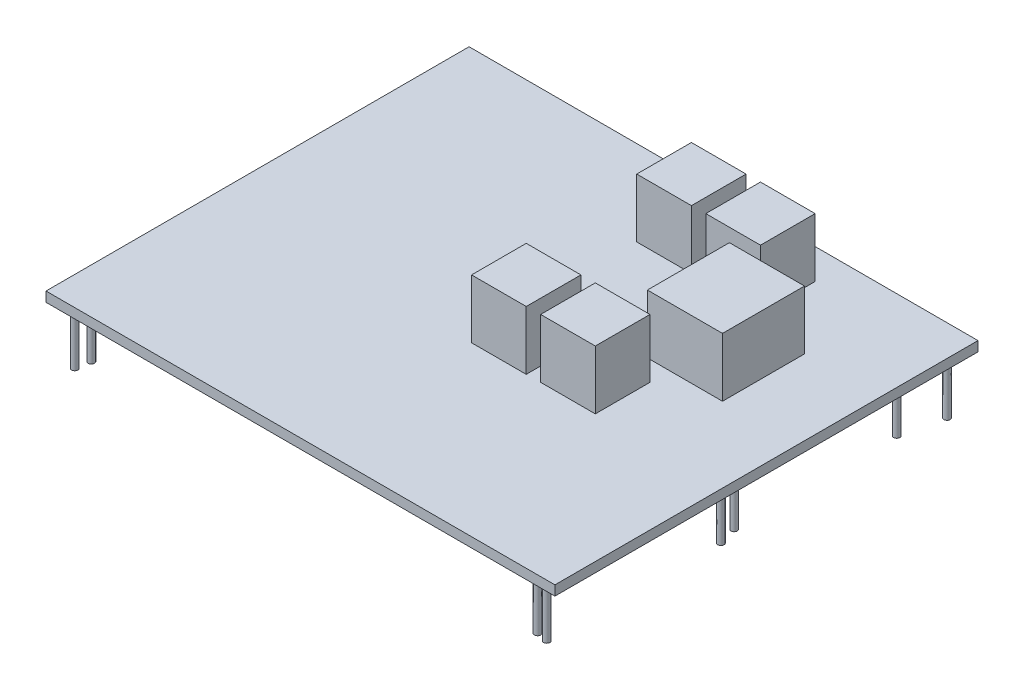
ISO-10303-21;
HEADER;
FILE_DESCRIPTION(('STEP AP214'),'2;1');
FILE_NAME('part.step','',(''),(''),'','','');
FILE_SCHEMA(('AUTOMOTIVE_DESIGN { 1 0 10303 214 1 1 1 1 }'));
ENDSEC;
DATA;
#1=APPLICATION_CONTEXT('core data for automotive mechanical design processes');
#2=APPLICATION_PROTOCOL_DEFINITION('international standard','automotive_design',2000,#1);
#3=PRODUCT_CONTEXT('',#1,'mechanical');
#4=PRODUCT('Part','Part','',(#3));
#5=PRODUCT_RELATED_PRODUCT_CATEGORY('part','',(#4));
#6=PRODUCT_DEFINITION_FORMATION('','',#4);
#7=PRODUCT_DEFINITION_CONTEXT('part definition',#1,'design');
#8=PRODUCT_DEFINITION('design','',#6,#7);
#9=PRODUCT_DEFINITION_SHAPE('','',#8);
#10=(LENGTH_UNIT() NAMED_UNIT(*) SI_UNIT(.MILLI.,.METRE.));
#11=(NAMED_UNIT(*) PLANE_ANGLE_UNIT() SI_UNIT($,.RADIAN.));
#12=(NAMED_UNIT(*) SI_UNIT($,.STERADIAN.) SOLID_ANGLE_UNIT());
#13=UNCERTAINTY_MEASURE_WITH_UNIT(LENGTH_MEASURE(1.E-05),#10,'distance_accuracy_value','');
#14=(GEOMETRIC_REPRESENTATION_CONTEXT(3) GLOBAL_UNCERTAINTY_ASSIGNED_CONTEXT((#13)) GLOBAL_UNIT_ASSIGNED_CONTEXT((#10,
#11,#12)) REPRESENTATION_CONTEXT('',''));
#15=CARTESIAN_POINT('',(0.,0.,0.));
#16=DIRECTION('',(0.,0.,1.));
#17=DIRECTION('',(1.,0.,0.));
#18=AXIS2_PLACEMENT_3D('',#15,#16,#17);
#19=CARTESIAN_POINT('',(0.,5.,0.));
#20=DIRECTION('',(0.,1.,0.));
#21=DIRECTION('',(0.,0.,1.));
#22=AXIS2_PLACEMENT_3D('',#19,#20,#21);
#23=PLANE('',#22);
#24=DIRECTION('',(0.,0.,1.));
#25=VECTOR('',#24,1.);
#26=CARTESIAN_POINT('',(-326.57219381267,5.,-108.190534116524));
#27=LINE('',#26,#25);
#28=CARTESIAN_POINT('',(-326.57219381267,5.,-108.190534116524));
#29=VERTEX_POINT('',#28);
#30=CARTESIAN_POINT('',(-326.57219381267,5.,107.709465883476));
#31=VERTEX_POINT('',#30);
#32=EDGE_CURVE('E536',#29,#31,#27,.T.);
#33=ORIENTED_EDGE('',*,*,#32,.T.);
#34=DIRECTION('',(1.,0.,0.));
#35=VECTOR('',#34,1.);
#36=CARTESIAN_POINT('',(-326.57219381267,5.,107.709465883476));
#37=LINE('',#36,#35);
#38=CARTESIAN_POINT('',(-66.8621938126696,5.,107.709465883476));
#39=VERTEX_POINT('',#38);
#40=EDGE_CURVE('E540',#31,#39,#37,.T.);
#41=ORIENTED_EDGE('',*,*,#40,.T.);
#42=DIRECTION('',(0.,0.,-1.));
#43=VECTOR('',#42,1.);
#44=CARTESIAN_POINT('',(-66.8621938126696,5.,-108.190534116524));
#45=LINE('',#44,#43);
#46=CARTESIAN_POINT('',(-66.8621938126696,5.,-108.190534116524));
#47=VERTEX_POINT('',#46);
#48=EDGE_CURVE('E544',#39,#47,#45,.T.);
#49=ORIENTED_EDGE('',*,*,#48,.T.);
#50=DIRECTION('',(-1.,0.,0.));
#51=VECTOR('',#50,1.);
#52=CARTESIAN_POINT('',(-326.57219381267,5.,-108.190534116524));
#53=LINE('',#52,#51);
#54=EDGE_CURVE('E547',#47,#29,#53,.T.);
#55=ORIENTED_EDGE('',*,*,#54,.T.);
#56=EDGE_LOOP('',(#33,#41,#49,#55));
#57=FACE_BOUND('',#56,.T.);
#58=DIRECTION('',(1.,0.,0.));
#59=VECTOR('',#58,1.);
#60=CARTESIAN_POINT('',(-143.558763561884,5.,-16.1733785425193));
#61=LINE('',#60,#59);
#62=CARTESIAN_POINT('',(-143.558763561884,5.,-16.1733785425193));
#63=VERTEX_POINT('',#62);
#64=CARTESIAN_POINT('',(-105.231829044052,5.,-16.1733785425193));
#65=VERTEX_POINT('',#64);
#66=EDGE_CURVE('E385',#63,#65,#61,.T.);
#67=ORIENTED_EDGE('',*,*,#66,.F.);
#68=DIRECTION('',(0.,0.,1.));
#69=VECTOR('',#68,1.);
#70=CARTESIAN_POINT('',(-143.558763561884,5.,-58.0246288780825));
#71=LINE('',#70,#69);
#72=CARTESIAN_POINT('',(-143.558763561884,5.,-58.0246288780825));
#73=VERTEX_POINT('',#72);
#74=EDGE_CURVE('E355',#73,#63,#71,.T.);
#75=ORIENTED_EDGE('',*,*,#74,.F.);
#76=DIRECTION('',(-1.,0.,0.));
#77=VECTOR('',#76,1.);
#78=CARTESIAN_POINT('',(-143.558763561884,5.,-58.0246288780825));
#79=LINE('',#78,#77);
#80=CARTESIAN_POINT('',(-105.231829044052,5.,-58.0246288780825));
#81=VERTEX_POINT('',#80);
#82=EDGE_CURVE('E372',#81,#73,#79,.T.);
#83=ORIENTED_EDGE('',*,*,#82,.F.);
#84=DIRECTION('',(0.,0.,-1.));
#85=VECTOR('',#84,1.);
#86=CARTESIAN_POINT('',(-105.231829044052,5.,-58.0246288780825));
#87=LINE('',#86,#85);
#88=EDGE_CURVE('E388',#65,#81,#87,.T.);
#89=ORIENTED_EDGE('',*,*,#88,.F.);
#90=EDGE_LOOP('',(#67,#75,#83,#89));
#91=FACE_BOUND('',#90,.T.);
#92=DIRECTION('',(1.,0.,0.));
#93=VECTOR('',#92,1.);
#94=CARTESIAN_POINT('',(-195.101882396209,5.,22.0067094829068));
#95=LINE('',#94,#93);
#96=CARTESIAN_POINT('',(-195.101882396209,5.,22.0067094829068));
#97=VERTEX_POINT('',#96);
#98=CARTESIAN_POINT('',(-167.201048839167,5.,22.0067094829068));
#99=VERTEX_POINT('',#98);
#100=EDGE_CURVE('E348',#97,#99,#95,.T.);
#101=ORIENTED_EDGE('',*,*,#100,.F.);
#102=DIRECTION('',(0.,0.,1.));
#103=VECTOR('',#102,1.);
#104=CARTESIAN_POINT('',(-195.101882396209,5.,-5.89412407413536));
#105=LINE('',#104,#103);
#106=CARTESIAN_POINT('',(-195.101882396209,5.,-5.89412407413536));
#107=VERTEX_POINT('',#106);
#108=EDGE_CURVE('E351',#107,#97,#105,.T.);
#109=ORIENTED_EDGE('',*,*,#108,.F.);
#110=DIRECTION('',(-1.,0.,0.));
#111=VECTOR('',#110,1.);
#112=CARTESIAN_POINT('',(-195.101882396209,5.,-5.89412407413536));
#113=LINE('',#112,#111);
#114=CARTESIAN_POINT('',(-167.201048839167,5.,-5.89412407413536));
#115=VERTEX_POINT('',#114);
#116=EDGE_CURVE('E340',#115,#107,#113,.T.);
#117=ORIENTED_EDGE('',*,*,#116,.F.);
#118=DIRECTION('',(0.,0.,-1.));
#119=VECTOR('',#118,1.);
#120=CARTESIAN_POINT('',(-167.201048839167,5.,-5.89412407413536));
#121=LINE('',#120,#119);
#122=EDGE_CURVE('E343',#99,#115,#121,.T.);
#123=ORIENTED_EDGE('',*,*,#122,.F.);
#124=EDGE_LOOP('',(#101,#109,#117,#123));
#125=FACE_BOUND('',#124,.T.);
#126=DIRECTION('',(1.,0.,0.));
#127=VECTOR('',#126,1.);
#128=CARTESIAN_POINT('',(-160.005570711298,5.,21.8598629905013));
#129=LINE('',#128,#127);
#130=CARTESIAN_POINT('',(-160.005570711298,5.,21.8598629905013));
#131=VERTEX_POINT('',#130);
#132=CARTESIAN_POINT('',(-132.104737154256,5.,21.8598629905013));
#133=VERTEX_POINT('',#132);
#134=EDGE_CURVE('E307',#131,#133,#129,.T.);
#135=ORIENTED_EDGE('',*,*,#134,.F.);
#136=DIRECTION('',(0.,0.,1.));
#137=VECTOR('',#136,1.);
#138=CARTESIAN_POINT('',(-160.005570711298,5.,-6.04097056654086));
#139=LINE('',#138,#137);
#140=CARTESIAN_POINT('',(-160.005570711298,5.,-6.04097056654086));
#141=VERTEX_POINT('',#140);
#142=EDGE_CURVE('E310',#141,#131,#139,.T.);
#143=ORIENTED_EDGE('',*,*,#142,.F.);
#144=DIRECTION('',(-1.,0.,0.));
#145=VECTOR('',#144,1.);
#146=CARTESIAN_POINT('',(-160.005570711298,5.,-6.04097056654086));
#147=LINE('',#146,#145);
#148=CARTESIAN_POINT('',(-132.104737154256,5.,-6.04097056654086));
#149=VERTEX_POINT('',#148);
#150=EDGE_CURVE('E299',#149,#141,#147,.T.);
#151=ORIENTED_EDGE('',*,*,#150,.F.);
#152=DIRECTION('',(0.,0.,-1.));
#153=VECTOR('',#152,1.);
#154=CARTESIAN_POINT('',(-132.104737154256,5.,-6.04097056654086));
#155=LINE('',#154,#153);
#156=EDGE_CURVE('E302',#133,#149,#155,.T.);
#157=ORIENTED_EDGE('',*,*,#156,.F.);
#158=EDGE_LOOP('',(#135,#143,#151,#157));
#159=FACE_BOUND('',#158,.T.);
#160=DIRECTION('',(1.,0.,0.));
#161=VECTOR('',#160,1.);
#162=CARTESIAN_POINT('',(-197.5248495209,5.,-64.7061442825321));
#163=LINE('',#162,#161);
#164=CARTESIAN_POINT('',(-197.5248495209,5.,-64.7061442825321));
#165=VERTEX_POINT('',#164);
#166=CARTESIAN_POINT('',(-169.624015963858,5.,-64.7061442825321));
#167=VERTEX_POINT('',#166);
#168=EDGE_CURVE('E266',#165,#167,#163,.T.);
#169=ORIENTED_EDGE('',*,*,#168,.F.);
#170=DIRECTION('',(0.,0.,1.));
#171=VECTOR('',#170,1.);
#172=CARTESIAN_POINT('',(-197.5248495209,5.,-92.6069778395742));
#173=LINE('',#172,#171);
#174=CARTESIAN_POINT('',(-197.5248495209,5.,-92.6069778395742));
#175=VERTEX_POINT('',#174);
#176=EDGE_CURVE('E269',#175,#165,#173,.T.);
#177=ORIENTED_EDGE('',*,*,#176,.F.);
#178=DIRECTION('',(-1.,0.,0.));
#179=VECTOR('',#178,1.);
#180=CARTESIAN_POINT('',(-197.5248495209,5.,-92.6069778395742));
#181=LINE('',#180,#179);
#182=CARTESIAN_POINT('',(-169.624015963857,5.,-92.6069778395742));
#183=VERTEX_POINT('',#182);
#184=EDGE_CURVE('E259',#183,#175,#181,.T.);
#185=ORIENTED_EDGE('',*,*,#184,.F.);
#186=DIRECTION('',(0.,0.,-1.));
#187=VECTOR('',#186,1.);
#188=CARTESIAN_POINT('',(-169.624015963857,5.,-92.6069778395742));
#189=LINE('',#188,#187);
#190=EDGE_CURVE('E262',#167,#183,#189,.T.);
#191=ORIENTED_EDGE('',*,*,#190,.F.);
#192=EDGE_LOOP('',(#169,#177,#185,#191));
#193=FACE_BOUND('',#192,.T.);
#194=DIRECTION('',(1.,0.,0.));
#195=VECTOR('',#194,1.);
#196=CARTESIAN_POINT('',(-162.428537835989,5.,-64.8529907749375));
#197=LINE('',#196,#195);
#198=CARTESIAN_POINT('',(-162.428537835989,5.,-64.8529907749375));
#199=VERTEX_POINT('',#198);
#200=CARTESIAN_POINT('',(-134.527704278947,5.,-64.8529907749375));
#201=VERTEX_POINT('',#200);
#202=EDGE_CURVE('E228',#199,#201,#197,.T.);
#203=ORIENTED_EDGE('',*,*,#202,.F.);
#204=DIRECTION('',(0.,0.,1.));
#205=VECTOR('',#204,1.);
#206=CARTESIAN_POINT('',(-162.428537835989,5.,-92.7538243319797));
#207=LINE('',#206,#205);
#208=CARTESIAN_POINT('',(-162.428537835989,5.,-92.7538243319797));
#209=VERTEX_POINT('',#208);
#210=EDGE_CURVE('E222',#209,#199,#207,.T.);
#211=ORIENTED_EDGE('',*,*,#210,.F.);
#212=DIRECTION('',(-1.,0.,0.));
#213=VECTOR('',#212,1.);
#214=CARTESIAN_POINT('',(-162.428537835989,5.,-92.7538243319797));
#215=LINE('',#214,#213);
#216=CARTESIAN_POINT('',(-134.527704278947,5.,-92.7538243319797));
#217=VERTEX_POINT('',#216);
#218=EDGE_CURVE('E206',#217,#209,#215,.T.);
#219=ORIENTED_EDGE('',*,*,#218,.F.);
#220=DIRECTION('',(0.,0.,-1.));
#221=VECTOR('',#220,1.);
#222=CARTESIAN_POINT('',(-134.527704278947,5.,-92.7538243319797));
#223=LINE('',#222,#221);
#224=EDGE_CURVE('E215',#201,#217,#223,.T.);
#225=ORIENTED_EDGE('',*,*,#224,.F.);
#226=EDGE_LOOP('',(#203,#211,#219,#225));
#227=FACE_BOUND('',#226,.T.);
#228=ADVANCED_FACE('F43',(#57,#91,#125,#159,#193,#227),#23,.T.);
#229=CARTESIAN_POINT('',(-326.57219381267,5.,-108.190534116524));
#230=DIRECTION('',(1.,0.,0.));
#231=DIRECTION('',(0.,0.,-1.));
#232=AXIS2_PLACEMENT_3D('',#229,#230,#231);
#233=PLANE('',#232);
#234=DIRECTION('',(0.,0.,1.));
#235=VECTOR('',#234,1.);
#236=CARTESIAN_POINT('',(-326.57219381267,0.,-108.190534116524));
#237=LINE('',#236,#235);
#238=CARTESIAN_POINT('',(-326.57219381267,0.,-108.190534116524));
#239=VERTEX_POINT('',#238);
#240=CARTESIAN_POINT('',(-326.57219381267,0.,107.709465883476));
#241=VERTEX_POINT('',#240);
#242=EDGE_CURVE('E532',#239,#241,#237,.T.);
#243=ORIENTED_EDGE('',*,*,#242,.T.);
#244=DIRECTION('',(0.,-1.,0.));
#245=VECTOR('',#244,1.);
#246=CARTESIAN_POINT('',(-326.57219381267,5.,107.709465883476));
#247=LINE('',#246,#245);
#248=EDGE_CURVE('E11',#31,#241,#247,.T.);
#249=ORIENTED_EDGE('',*,*,#248,.F.);
#250=ORIENTED_EDGE('',*,*,#32,.F.);
#251=DIRECTION('',(0.,-1.,0.));
#252=VECTOR('',#251,1.);
#253=CARTESIAN_POINT('',(-326.57219381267,5.,-108.190534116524));
#254=LINE('',#253,#252);
#255=EDGE_CURVE('E550',#29,#239,#254,.T.);
#256=ORIENTED_EDGE('',*,*,#255,.T.);
#257=EDGE_LOOP('',(#243,#249,#250,#256));
#258=FACE_BOUND('',#257,.T.);
#259=ADVANCED_FACE('F45',(#258),#233,.F.);
#260=CARTESIAN_POINT('',(-326.57219381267,5.,107.709465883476));
#261=DIRECTION('',(0.,0.,-1.));
#262=DIRECTION('',(-1.,0.,0.));
#263=AXIS2_PLACEMENT_3D('',#260,#261,#262);
#264=PLANE('',#263);
#265=DIRECTION('',(1.,0.,0.));
#266=VECTOR('',#265,1.);
#267=CARTESIAN_POINT('',(-326.57219381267,0.,107.709465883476));
#268=LINE('',#267,#266);
#269=CARTESIAN_POINT('',(-66.8621938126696,0.,107.709465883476));
#270=VERTEX_POINT('',#269);
#271=EDGE_CURVE('E554',#241,#270,#268,.T.);
#272=ORIENTED_EDGE('',*,*,#271,.T.);
#273=DIRECTION('',(0.,-1.,0.));
#274=VECTOR('',#273,1.);
#275=CARTESIAN_POINT('',(-66.8621938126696,5.,107.709465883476));
#276=LINE('',#275,#274);
#277=EDGE_CURVE('E52',#39,#270,#276,.T.);
#278=ORIENTED_EDGE('',*,*,#277,.F.);
#279=ORIENTED_EDGE('',*,*,#40,.F.);
#280=ORIENTED_EDGE('',*,*,#248,.T.);
#281=EDGE_LOOP('',(#272,#278,#279,#280));
#282=FACE_BOUND('',#281,.T.);
#283=ADVANCED_FACE('F590',(#282),#264,.F.);
#284=CARTESIAN_POINT('',(-66.8621938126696,5.,-108.190534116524));
#285=DIRECTION('',(-1.,0.,0.));
#286=DIRECTION('',(0.,0.,1.));
#287=AXIS2_PLACEMENT_3D('',#284,#285,#286);
#288=PLANE('',#287);
#289=DIRECTION('',(0.,0.,-1.));
#290=VECTOR('',#289,1.);
#291=CARTESIAN_POINT('',(-66.8621938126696,0.,-108.190534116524));
#292=LINE('',#291,#290);
#293=CARTESIAN_POINT('',(-66.8621938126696,0.,-108.190534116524));
#294=VERTEX_POINT('',#293);
#295=EDGE_CURVE('E557',#270,#294,#292,.T.);
#296=ORIENTED_EDGE('',*,*,#295,.T.);
#297=DIRECTION('',(0.,-1.,0.));
#298=VECTOR('',#297,1.);
#299=CARTESIAN_POINT('',(-66.8621938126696,5.,-108.190534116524));
#300=LINE('',#299,#298);
#301=EDGE_CURVE('E565',#47,#294,#300,.T.);
#302=ORIENTED_EDGE('',*,*,#301,.F.);
#303=ORIENTED_EDGE('',*,*,#48,.F.);
#304=ORIENTED_EDGE('',*,*,#277,.T.);
#305=EDGE_LOOP('',(#296,#302,#303,#304));
#306=FACE_BOUND('',#305,.T.);
#307=ADVANCED_FACE('F574',(#306),#288,.F.);
#308=CARTESIAN_POINT('',(-326.57219381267,5.,-108.190534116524));
#309=DIRECTION('',(0.,0.,1.));
#310=DIRECTION('',(1.,0.,0.));
#311=AXIS2_PLACEMENT_3D('',#308,#309,#310);
#312=PLANE('',#311);
#313=DIRECTION('',(-1.,0.,0.));
#314=VECTOR('',#313,1.);
#315=CARTESIAN_POINT('',(-326.57219381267,0.,-108.190534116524));
#316=LINE('',#315,#314);
#317=EDGE_CURVE('E541',#294,#239,#316,.T.);
#318=ORIENTED_EDGE('',*,*,#317,.T.);
#319=ORIENTED_EDGE('',*,*,#255,.F.);
#320=ORIENTED_EDGE('',*,*,#54,.F.);
#321=ORIENTED_EDGE('',*,*,#301,.T.);
#322=EDGE_LOOP('',(#318,#319,#320,#321));
#323=FACE_BOUND('',#322,.T.);
#324=ADVANCED_FACE('F583',(#323),#312,.F.);
#325=CARTESIAN_POINT('',(0.,0.,0.));
#326=DIRECTION('',(0.,1.,0.));
#327=DIRECTION('',(0.,0.,1.));
#328=AXIS2_PLACEMENT_3D('',#325,#326,#327);
#329=PLANE('',#328);
#330=CARTESIAN_POINT('',(-224.84219381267,0.,-89.7805341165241));
#331=DIRECTION('',(0.,1.,0.));
#332=DIRECTION('',(0.,0.,1.));
#333=AXIS2_PLACEMENT_3D('',#330,#331,#332);
#334=CIRCLE('',#333,1.60000000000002);
#335=CARTESIAN_POINT('',(-224.84219381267,0.,-88.1805341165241));
#336=VERTEX_POINT('',#335);
#337=EDGE_CURVE('E408',#336,#336,#334,.T.);
#338=ORIENTED_EDGE('',*,*,#337,.T.);
#339=EDGE_LOOP('',(#338));
#340=FACE_BOUND('',#339,.T.);
#341=CARTESIAN_POINT('',(-75.6221938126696,0.,-101.170534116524));
#342=DIRECTION('',(0.,1.,0.));
#343=DIRECTION('',(0.,0.,1.));
#344=AXIS2_PLACEMENT_3D('',#341,#342,#343);
#345=CIRCLE('',#344,1.60000000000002);
#346=CARTESIAN_POINT('',(-75.6221938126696,0.,-99.570534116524));
#347=VERTEX_POINT('',#346);
#348=EDGE_CURVE('E416',#347,#347,#345,.T.);
#349=ORIENTED_EDGE('',*,*,#348,.T.);
#350=EDGE_LOOP('',(#349));
#351=FACE_BOUND('',#350,.T.);
#352=CARTESIAN_POINT('',(-80.5421938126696,0.,-80.410534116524));
#353=DIRECTION('',(0.,1.,0.));
#354=DIRECTION('',(0.,0.,1.));
#355=AXIS2_PLACEMENT_3D('',#352,#353,#354);
#356=CIRCLE('',#355,1.60000000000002);
#357=CARTESIAN_POINT('',(-80.5421938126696,0.,-78.810534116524));
#358=VERTEX_POINT('',#357);
#359=EDGE_CURVE('E424',#358,#358,#356,.T.);
#360=ORIENTED_EDGE('',*,*,#359,.T.);
#361=EDGE_LOOP('',(#360));
#362=FACE_BOUND('',#361,.T.);
#363=CARTESIAN_POINT('',(-104.37219381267,0.,-71.8805341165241));
#364=DIRECTION('',(0.,1.,0.));
#365=DIRECTION('',(0.,0.,1.));
#366=AXIS2_PLACEMENT_3D('',#363,#364,#365);
#367=CIRCLE('',#366,1.60000000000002);
#368=CARTESIAN_POINT('',(-104.37219381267,0.,-70.2805341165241));
#369=VERTEX_POINT('',#368);
#370=EDGE_CURVE('E432',#369,#369,#367,.T.);
#371=ORIENTED_EDGE('',*,*,#370,.T.);
#372=EDGE_LOOP('',(#371));
#373=FACE_BOUND('',#372,.T.);
#374=CARTESIAN_POINT('',(-79.2597569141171,0.,99.4894658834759));
#375=DIRECTION('',(0.,1.,0.));
#376=DIRECTION('',(0.,0.,1.));
#377=AXIS2_PLACEMENT_3D('',#374,#375,#376);
#378=CIRCLE('',#377,1.60000000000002);
#379=CARTESIAN_POINT('',(-79.2597569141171,0.,101.089465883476));
#380=VERTEX_POINT('',#379);
#381=EDGE_CURVE('E440',#380,#380,#378,.T.);
#382=ORIENTED_EDGE('',*,*,#381,.T.);
#383=EDGE_LOOP('',(#382));
#384=FACE_BOUND('',#383,.T.);
#385=CARTESIAN_POINT('',(-84.9021938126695,0.,98.5294658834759));
#386=DIRECTION('',(0.,1.,0.));
#387=DIRECTION('',(0.,0.,1.));
#388=AXIS2_PLACEMENT_3D('',#385,#386,#387);
#389=CIRCLE('',#388,1.60000000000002);
#390=CARTESIAN_POINT('',(-84.9021938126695,0.,100.129465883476));
#391=VERTEX_POINT('',#390);
#392=EDGE_CURVE('E448',#391,#391,#389,.T.);
#393=ORIENTED_EDGE('',*,*,#392,.T.);
#394=EDGE_LOOP('',(#393));
#395=FACE_BOUND('',#394,.T.);
#396=CARTESIAN_POINT('',(-80.7021938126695,0.,2.38946588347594));
#397=DIRECTION('',(0.,1.,0.));
#398=DIRECTION('',(0.,0.,1.));
#399=AXIS2_PLACEMENT_3D('',#396,#397,#398);
#400=CIRCLE('',#399,1.60000000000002);
#401=CARTESIAN_POINT('',(-80.7021938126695,0.,3.98946588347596));
#402=VERTEX_POINT('',#401);
#403=EDGE_CURVE('E456',#402,#402,#400,.T.);
#404=ORIENTED_EDGE('',*,*,#403,.T.);
#405=EDGE_LOOP('',(#404));
#406=FACE_BOUND('',#405,.T.);
#407=CARTESIAN_POINT('',(-77.9921938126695,0.,11.8594658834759));
#408=DIRECTION('',(0.,1.,0.));
#409=DIRECTION('',(0.,0.,1.));
#410=AXIS2_PLACEMENT_3D('',#407,#408,#409);
#411=CIRCLE('',#410,1.60000000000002);
#412=CARTESIAN_POINT('',(-77.9921938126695,0.,13.459465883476));
#413=VERTEX_POINT('',#412);
#414=EDGE_CURVE('E464',#413,#413,#411,.T.);
#415=ORIENTED_EDGE('',*,*,#414,.T.);
#416=EDGE_LOOP('',(#415));
#417=FACE_BOUND('',#416,.T.);
#418=CARTESIAN_POINT('',(-216.14219381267,0.,6.76946588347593));
#419=DIRECTION('',(0.,1.,0.));
#420=DIRECTION('',(0.,0.,1.));
#421=AXIS2_PLACEMENT_3D('',#418,#419,#420);
#422=CIRCLE('',#421,1.60000000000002);
#423=CARTESIAN_POINT('',(-216.14219381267,0.,8.36946588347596));
#424=VERTEX_POINT('',#423);
#425=EDGE_CURVE('E472',#424,#424,#422,.T.);
#426=ORIENTED_EDGE('',*,*,#425,.T.);
#427=EDGE_LOOP('',(#426));
#428=FACE_BOUND('',#427,.T.);
#429=CARTESIAN_POINT('',(-104.38219381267,0.,25.1494658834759));
#430=DIRECTION('',(0.,1.,0.));
#431=DIRECTION('',(0.,0.,1.));
#432=AXIS2_PLACEMENT_3D('',#429,#430,#431);
#433=CIRCLE('',#432,1.60000000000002);
#434=CARTESIAN_POINT('',(-104.38219381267,0.,26.749465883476));
#435=VERTEX_POINT('',#434);
#436=EDGE_CURVE('E480',#435,#435,#433,.T.);
#437=ORIENTED_EDGE('',*,*,#436,.T.);
#438=EDGE_LOOP('',(#437));
#439=FACE_BOUND('',#438,.T.);
#440=CARTESIAN_POINT('',(-170.24219381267,0.,34.3994658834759));
#441=DIRECTION('',(0.,1.,0.));
#442=DIRECTION('',(0.,0.,1.));
#443=AXIS2_PLACEMENT_3D('',#440,#441,#442);
#444=CIRCLE('',#443,1.60000000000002);
#445=CARTESIAN_POINT('',(-170.24219381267,0.,35.9994658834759));
#446=VERTEX_POINT('',#445);
#447=EDGE_CURVE('E488',#446,#446,#444,.T.);
#448=ORIENTED_EDGE('',*,*,#447,.T.);
#449=EDGE_LOOP('',(#448));
#450=FACE_BOUND('',#449,.T.);
#451=CARTESIAN_POINT('',(-177.86219381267,0.,34.3994658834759));
#452=DIRECTION('',(0.,1.,0.));
#453=DIRECTION('',(0.,0.,1.));
#454=AXIS2_PLACEMENT_3D('',#451,#452,#453);
#455=CIRCLE('',#454,1.60000000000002);
#456=CARTESIAN_POINT('',(-177.86219381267,0.,35.9994658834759));
#457=VERTEX_POINT('',#456);
#458=EDGE_CURVE('E496',#457,#457,#455,.T.);
#459=ORIENTED_EDGE('',*,*,#458,.T.);
#460=EDGE_LOOP('',(#459));
#461=FACE_BOUND('',#460,.T.);
#462=CARTESIAN_POINT('',(-320.10219381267,0.,99.4894658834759));
#463=DIRECTION('',(0.,1.,0.));
#464=DIRECTION('',(0.,0.,1.));
#465=AXIS2_PLACEMENT_3D('',#462,#463,#464);
#466=CIRCLE('',#465,1.60000000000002);
#467=CARTESIAN_POINT('',(-320.10219381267,0.,101.089465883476));
#468=VERTEX_POINT('',#467);
#469=EDGE_CURVE('E504',#468,#468,#466,.T.);
#470=ORIENTED_EDGE('',*,*,#469,.T.);
#471=EDGE_LOOP('',(#470));
#472=FACE_BOUND('',#471,.T.);
#473=CARTESIAN_POINT('',(-318.83219381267,0.,92.3094658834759));
#474=DIRECTION('',(0.,1.,0.));
#475=DIRECTION('',(0.,0.,1.));
#476=AXIS2_PLACEMENT_3D('',#473,#474,#475);
#477=CIRCLE('',#476,1.60000000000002);
#478=CARTESIAN_POINT('',(-318.83219381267,0.,93.909465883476));
#479=VERTEX_POINT('',#478);
#480=EDGE_CURVE('E512',#479,#479,#477,.T.);
#481=ORIENTED_EDGE('',*,*,#480,.T.);
#482=EDGE_LOOP('',(#481));
#483=FACE_BOUND('',#482,.T.);
#484=CARTESIAN_POINT('',(-312.852193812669,0.,-99.8505341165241));
#485=DIRECTION('',(0.,1.,0.));
#486=DIRECTION('',(0.,0.,1.));
#487=AXIS2_PLACEMENT_3D('',#484,#485,#486);
#488=CIRCLE('',#487,1.60000000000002);
#489=CARTESIAN_POINT('',(-312.852193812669,0.,-98.250534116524));
#490=VERTEX_POINT('',#489);
#491=EDGE_CURVE('E520',#490,#490,#488,.T.);
#492=ORIENTED_EDGE('',*,*,#491,.T.);
#493=EDGE_LOOP('',(#492));
#494=FACE_BOUND('',#493,.T.);
#495=CARTESIAN_POINT('',(-320.09219381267,0.,-101.170534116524));
#496=DIRECTION('',(0.,1.,0.));
#497=DIRECTION('',(0.,0.,1.));
#498=AXIS2_PLACEMENT_3D('',#495,#496,#497);
#499=CIRCLE('',#498,1.60000000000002);
#500=CARTESIAN_POINT('',(-320.09219381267,0.,-99.570534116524));
#501=VERTEX_POINT('',#500);
#502=EDGE_CURVE('E524',#501,#501,#499,.T.);
#503=ORIENTED_EDGE('',*,*,#502,.T.);
#504=EDGE_LOOP('',(#503));
#505=FACE_BOUND('',#504,.T.);
#506=ORIENTED_EDGE('',*,*,#242,.F.);
#507=ORIENTED_EDGE('',*,*,#317,.F.);
#508=ORIENTED_EDGE('',*,*,#295,.F.);
#509=ORIENTED_EDGE('',*,*,#271,.F.);
#510=EDGE_LOOP('',(#506,#507,#508,#509));
#511=FACE_BOUND('',#510,.T.);
#512=ADVANCED_FACE('F580',(#340,#351,#362,#373,#384,#395,#406,#417,#428,#439,#450,#461,#472,
#483,#494,#505,#511),#329,.F.);
#513=CARTESIAN_POINT('',(-320.09219381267,-30.,-101.170534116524));
#514=DIRECTION('',(0.,1.,0.));
#515=DIRECTION('',(0.,0.,1.));
#516=AXIS2_PLACEMENT_3D('',#513,#514,#515);
#517=CYLINDRICAL_SURFACE('',#516,1.60000000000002);
#518=CARTESIAN_POINT('',(-320.09219381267,-30.,-101.170534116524));
#519=DIRECTION('',(0.,1.,0.));
#520=DIRECTION('',(0.,0.,1.));
#521=AXIS2_PLACEMENT_3D('',#518,#519,#520);
#522=CIRCLE('',#521,1.60000000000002);
#523=CARTESIAN_POINT('',(-320.09219381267,-30.,-99.570534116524));
#524=VERTEX_POINT('',#523);
#525=EDGE_CURVE('E528',#524,#524,#522,.T.);
#526=ORIENTED_EDGE('',*,*,#525,.T.);
#527=EDGE_LOOP('',(#526));
#528=FACE_BOUND('',#527,.T.);
#529=ORIENTED_EDGE('',*,*,#502,.F.);
#530=EDGE_LOOP('',(#529));
#531=FACE_BOUND('',#530,.T.);
#532=ADVANCED_FACE('F603',(#528,#531),#517,.T.);
#533=CARTESIAN_POINT('',(-320.09219381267,-30.,-101.170534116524));
#534=DIRECTION('',(0.,1.,0.));
#535=DIRECTION('',(0.,0.,1.));
#536=AXIS2_PLACEMENT_3D('',#533,#534,#535);
#537=PLANE('',#536);
#538=ORIENTED_EDGE('',*,*,#525,.F.);
#539=EDGE_LOOP('',(#538));
#540=FACE_BOUND('',#539,.T.);
#541=ADVANCED_FACE('F623',(#540),#537,.F.);
#542=CARTESIAN_POINT('',(-312.852193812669,-30.,-99.8505341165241));
#543=DIRECTION('',(0.,1.,0.));
#544=DIRECTION('',(0.,0.,1.));
#545=AXIS2_PLACEMENT_3D('',#542,#543,#544);
#546=CYLINDRICAL_SURFACE('',#545,1.60000000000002);
#547=CARTESIAN_POINT('',(-312.852193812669,-30.,-99.8505341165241));
#548=DIRECTION('',(0.,1.,0.));
#549=DIRECTION('',(0.,0.,1.));
#550=AXIS2_PLACEMENT_3D('',#547,#548,#549);
#551=CIRCLE('',#550,1.60000000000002);
#552=CARTESIAN_POINT('',(-312.852193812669,-30.,-98.250534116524));
#553=VERTEX_POINT('',#552);
#554=EDGE_CURVE('E516',#553,#553,#551,.T.);
#555=ORIENTED_EDGE('',*,*,#554,.T.);
#556=EDGE_LOOP('',(#555));
#557=FACE_BOUND('',#556,.T.);
#558=ORIENTED_EDGE('',*,*,#491,.F.);
#559=EDGE_LOOP('',(#558));
#560=FACE_BOUND('',#559,.T.);
#561=ADVANCED_FACE('F630',(#557,#560),#546,.T.);
#562=CARTESIAN_POINT('',(-312.852193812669,-30.,-99.8505341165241));
#563=DIRECTION('',(0.,1.,0.));
#564=DIRECTION('',(0.,0.,1.));
#565=AXIS2_PLACEMENT_3D('',#562,#563,#564);
#566=PLANE('',#565);
#567=ORIENTED_EDGE('',*,*,#554,.F.);
#568=EDGE_LOOP('',(#567));
#569=FACE_BOUND('',#568,.T.);
#570=ADVANCED_FACE('F637',(#569),#566,.F.);
#571=CARTESIAN_POINT('',(-318.83219381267,-30.,92.3094658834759));
#572=DIRECTION('',(0.,1.,0.));
#573=DIRECTION('',(0.,0.,1.));
#574=AXIS2_PLACEMENT_3D('',#571,#572,#573);
#575=CYLINDRICAL_SURFACE('',#574,1.60000000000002);
#576=CARTESIAN_POINT('',(-318.83219381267,-30.,92.3094658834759));
#577=DIRECTION('',(0.,1.,0.));
#578=DIRECTION('',(0.,0.,1.));
#579=AXIS2_PLACEMENT_3D('',#576,#577,#578);
#580=CIRCLE('',#579,1.60000000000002);
#581=CARTESIAN_POINT('',(-318.83219381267,-30.,93.909465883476));
#582=VERTEX_POINT('',#581);
#583=EDGE_CURVE('E508',#582,#582,#580,.T.);
#584=ORIENTED_EDGE('',*,*,#583,.T.);
#585=EDGE_LOOP('',(#584));
#586=FACE_BOUND('',#585,.T.);
#587=ORIENTED_EDGE('',*,*,#480,.F.);
#588=EDGE_LOOP('',(#587));
#589=FACE_BOUND('',#588,.T.);
#590=ADVANCED_FACE('F645',(#586,#589),#575,.T.);
#591=CARTESIAN_POINT('',(-318.83219381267,-30.,92.3094658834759));
#592=DIRECTION('',(0.,1.,0.));
#593=DIRECTION('',(0.,0.,1.));
#594=AXIS2_PLACEMENT_3D('',#591,#592,#593);
#595=PLANE('',#594);
#596=ORIENTED_EDGE('',*,*,#583,.F.);
#597=EDGE_LOOP('',(#596));
#598=FACE_BOUND('',#597,.T.);
#599=ADVANCED_FACE('F653',(#598),#595,.F.);
#600=CARTESIAN_POINT('',(-320.10219381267,-30.,99.4894658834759));
#601=DIRECTION('',(0.,1.,0.));
#602=DIRECTION('',(0.,0.,1.));
#603=AXIS2_PLACEMENT_3D('',#600,#601,#602);
#604=CYLINDRICAL_SURFACE('',#603,1.60000000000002);
#605=CARTESIAN_POINT('',(-320.10219381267,-30.,99.4894658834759));
#606=DIRECTION('',(0.,1.,0.));
#607=DIRECTION('',(0.,0.,1.));
#608=AXIS2_PLACEMENT_3D('',#605,#606,#607);
#609=CIRCLE('',#608,1.60000000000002);
#610=CARTESIAN_POINT('',(-320.10219381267,-30.,101.089465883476));
#611=VERTEX_POINT('',#610);
#612=EDGE_CURVE('E500',#611,#611,#609,.T.);
#613=ORIENTED_EDGE('',*,*,#612,.T.);
#614=EDGE_LOOP('',(#613));
#615=FACE_BOUND('',#614,.T.);
#616=ORIENTED_EDGE('',*,*,#469,.F.);
#617=EDGE_LOOP('',(#616));
#618=FACE_BOUND('',#617,.T.);
#619=ADVANCED_FACE('F661',(#615,#618),#604,.T.);
#620=CARTESIAN_POINT('',(-320.10219381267,-30.,99.4894658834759));
#621=DIRECTION('',(0.,1.,0.));
#622=DIRECTION('',(0.,0.,1.));
#623=AXIS2_PLACEMENT_3D('',#620,#621,#622);
#624=PLANE('',#623);
#625=ORIENTED_EDGE('',*,*,#612,.F.);
#626=EDGE_LOOP('',(#625));
#627=FACE_BOUND('',#626,.T.);
#628=ADVANCED_FACE('F669',(#627),#624,.F.);
#629=CARTESIAN_POINT('',(-177.86219381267,-30.,34.3994658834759));
#630=DIRECTION('',(0.,1.,0.));
#631=DIRECTION('',(0.,0.,1.));
#632=AXIS2_PLACEMENT_3D('',#629,#630,#631);
#633=CYLINDRICAL_SURFACE('',#632,1.60000000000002);
#634=CARTESIAN_POINT('',(-177.86219381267,-30.,34.3994658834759));
#635=DIRECTION('',(0.,1.,0.));
#636=DIRECTION('',(0.,0.,1.));
#637=AXIS2_PLACEMENT_3D('',#634,#635,#636);
#638=CIRCLE('',#637,1.60000000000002);
#639=CARTESIAN_POINT('',(-177.86219381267,-30.,35.9994658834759));
#640=VERTEX_POINT('',#639);
#641=EDGE_CURVE('E492',#640,#640,#638,.T.);
#642=ORIENTED_EDGE('',*,*,#641,.T.);
#643=EDGE_LOOP('',(#642));
#644=FACE_BOUND('',#643,.T.);
#645=ORIENTED_EDGE('',*,*,#458,.F.);
#646=EDGE_LOOP('',(#645));
#647=FACE_BOUND('',#646,.T.);
#648=ADVANCED_FACE('F677',(#644,#647),#633,.T.);
#649=CARTESIAN_POINT('',(-177.86219381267,-30.,34.3994658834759));
#650=DIRECTION('',(0.,1.,0.));
#651=DIRECTION('',(0.,0.,1.));
#652=AXIS2_PLACEMENT_3D('',#649,#650,#651);
#653=PLANE('',#652);
#654=ORIENTED_EDGE('',*,*,#641,.F.);
#655=EDGE_LOOP('',(#654));
#656=FACE_BOUND('',#655,.T.);
#657=ADVANCED_FACE('F685',(#656),#653,.F.);
#658=CARTESIAN_POINT('',(-170.24219381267,-30.,34.3994658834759));
#659=DIRECTION('',(0.,1.,0.));
#660=DIRECTION('',(0.,0.,1.));
#661=AXIS2_PLACEMENT_3D('',#658,#659,#660);
#662=CYLINDRICAL_SURFACE('',#661,1.60000000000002);
#663=CARTESIAN_POINT('',(-170.24219381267,-30.,34.3994658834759));
#664=DIRECTION('',(0.,1.,0.));
#665=DIRECTION('',(0.,0.,1.));
#666=AXIS2_PLACEMENT_3D('',#663,#664,#665);
#667=CIRCLE('',#666,1.60000000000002);
#668=CARTESIAN_POINT('',(-170.24219381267,-30.,35.9994658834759));
#669=VERTEX_POINT('',#668);
#670=EDGE_CURVE('E484',#669,#669,#667,.T.);
#671=ORIENTED_EDGE('',*,*,#670,.T.);
#672=EDGE_LOOP('',(#671));
#673=FACE_BOUND('',#672,.T.);
#674=ORIENTED_EDGE('',*,*,#447,.F.);
#675=EDGE_LOOP('',(#674));
#676=FACE_BOUND('',#675,.T.);
#677=ADVANCED_FACE('F693',(#673,#676),#662,.T.);
#678=CARTESIAN_POINT('',(-170.24219381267,-30.,34.3994658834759));
#679=DIRECTION('',(0.,1.,0.));
#680=DIRECTION('',(0.,0.,1.));
#681=AXIS2_PLACEMENT_3D('',#678,#679,#680);
#682=PLANE('',#681);
#683=ORIENTED_EDGE('',*,*,#670,.F.);
#684=EDGE_LOOP('',(#683));
#685=FACE_BOUND('',#684,.T.);
#686=ADVANCED_FACE('F701',(#685),#682,.F.);
#687=CARTESIAN_POINT('',(-104.38219381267,-30.,25.1494658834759));
#688=DIRECTION('',(0.,1.,0.));
#689=DIRECTION('',(0.,0.,1.));
#690=AXIS2_PLACEMENT_3D('',#687,#688,#689);
#691=CYLINDRICAL_SURFACE('',#690,1.60000000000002);
#692=CARTESIAN_POINT('',(-104.38219381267,-30.,25.1494658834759));
#693=DIRECTION('',(0.,1.,0.));
#694=DIRECTION('',(0.,0.,1.));
#695=AXIS2_PLACEMENT_3D('',#692,#693,#694);
#696=CIRCLE('',#695,1.60000000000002);
#697=CARTESIAN_POINT('',(-104.38219381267,-30.,26.749465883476));
#698=VERTEX_POINT('',#697);
#699=EDGE_CURVE('E476',#698,#698,#696,.T.);
#700=ORIENTED_EDGE('',*,*,#699,.T.);
#701=EDGE_LOOP('',(#700));
#702=FACE_BOUND('',#701,.T.);
#703=ORIENTED_EDGE('',*,*,#436,.F.);
#704=EDGE_LOOP('',(#703));
#705=FACE_BOUND('',#704,.T.);
#706=ADVANCED_FACE('F709',(#702,#705),#691,.T.);
#707=CARTESIAN_POINT('',(-104.38219381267,-30.,25.1494658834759));
#708=DIRECTION('',(0.,1.,0.));
#709=DIRECTION('',(0.,0.,1.));
#710=AXIS2_PLACEMENT_3D('',#707,#708,#709);
#711=PLANE('',#710);
#712=ORIENTED_EDGE('',*,*,#699,.F.);
#713=EDGE_LOOP('',(#712));
#714=FACE_BOUND('',#713,.T.);
#715=ADVANCED_FACE('F717',(#714),#711,.F.);
#716=CARTESIAN_POINT('',(-216.14219381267,-30.,6.76946588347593));
#717=DIRECTION('',(0.,1.,0.));
#718=DIRECTION('',(0.,0.,1.));
#719=AXIS2_PLACEMENT_3D('',#716,#717,#718);
#720=CYLINDRICAL_SURFACE('',#719,1.60000000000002);
#721=CARTESIAN_POINT('',(-216.14219381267,-30.,6.76946588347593));
#722=DIRECTION('',(0.,1.,0.));
#723=DIRECTION('',(0.,0.,1.));
#724=AXIS2_PLACEMENT_3D('',#721,#722,#723);
#725=CIRCLE('',#724,1.60000000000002);
#726=CARTESIAN_POINT('',(-216.14219381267,-30.,8.36946588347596));
#727=VERTEX_POINT('',#726);
#728=EDGE_CURVE('E468',#727,#727,#725,.T.);
#729=ORIENTED_EDGE('',*,*,#728,.T.);
#730=EDGE_LOOP('',(#729));
#731=FACE_BOUND('',#730,.T.);
#732=ORIENTED_EDGE('',*,*,#425,.F.);
#733=EDGE_LOOP('',(#732));
#734=FACE_BOUND('',#733,.T.);
#735=ADVANCED_FACE('F725',(#731,#734),#720,.T.);
#736=CARTESIAN_POINT('',(-216.14219381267,-30.,6.76946588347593));
#737=DIRECTION('',(0.,1.,0.));
#738=DIRECTION('',(0.,0.,1.));
#739=AXIS2_PLACEMENT_3D('',#736,#737,#738);
#740=PLANE('',#739);
#741=ORIENTED_EDGE('',*,*,#728,.F.);
#742=EDGE_LOOP('',(#741));
#743=FACE_BOUND('',#742,.T.);
#744=ADVANCED_FACE('F733',(#743),#740,.F.);
#745=CARTESIAN_POINT('',(-77.9921938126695,-30.,11.8594658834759));
#746=DIRECTION('',(0.,1.,0.));
#747=DIRECTION('',(0.,0.,1.));
#748=AXIS2_PLACEMENT_3D('',#745,#746,#747);
#749=CYLINDRICAL_SURFACE('',#748,1.60000000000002);
#750=CARTESIAN_POINT('',(-77.9921938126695,-30.,11.8594658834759));
#751=DIRECTION('',(0.,1.,0.));
#752=DIRECTION('',(0.,0.,1.));
#753=AXIS2_PLACEMENT_3D('',#750,#751,#752);
#754=CIRCLE('',#753,1.60000000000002);
#755=CARTESIAN_POINT('',(-77.9921938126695,-30.,13.459465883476));
#756=VERTEX_POINT('',#755);
#757=EDGE_CURVE('E460',#756,#756,#754,.T.);
#758=ORIENTED_EDGE('',*,*,#757,.T.);
#759=EDGE_LOOP('',(#758));
#760=FACE_BOUND('',#759,.T.);
#761=ORIENTED_EDGE('',*,*,#414,.F.);
#762=EDGE_LOOP('',(#761));
#763=FACE_BOUND('',#762,.T.);
#764=ADVANCED_FACE('F741',(#760,#763),#749,.T.);
#765=CARTESIAN_POINT('',(-77.9921938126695,-30.,11.8594658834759));
#766=DIRECTION('',(0.,1.,0.));
#767=DIRECTION('',(0.,0.,1.));
#768=AXIS2_PLACEMENT_3D('',#765,#766,#767);
#769=PLANE('',#768);
#770=ORIENTED_EDGE('',*,*,#757,.F.);
#771=EDGE_LOOP('',(#770));
#772=FACE_BOUND('',#771,.T.);
#773=ADVANCED_FACE('F749',(#772),#769,.F.);
#774=CARTESIAN_POINT('',(-80.7021938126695,-30.,2.38946588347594));
#775=DIRECTION('',(0.,1.,0.));
#776=DIRECTION('',(0.,0.,1.));
#777=AXIS2_PLACEMENT_3D('',#774,#775,#776);
#778=CYLINDRICAL_SURFACE('',#777,1.60000000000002);
#779=CARTESIAN_POINT('',(-80.7021938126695,-30.,2.38946588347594));
#780=DIRECTION('',(0.,1.,0.));
#781=DIRECTION('',(0.,0.,1.));
#782=AXIS2_PLACEMENT_3D('',#779,#780,#781);
#783=CIRCLE('',#782,1.60000000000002);
#784=CARTESIAN_POINT('',(-80.7021938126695,-30.,3.98946588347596));
#785=VERTEX_POINT('',#784);
#786=EDGE_CURVE('E452',#785,#785,#783,.T.);
#787=ORIENTED_EDGE('',*,*,#786,.T.);
#788=EDGE_LOOP('',(#787));
#789=FACE_BOUND('',#788,.T.);
#790=ORIENTED_EDGE('',*,*,#403,.F.);
#791=EDGE_LOOP('',(#790));
#792=FACE_BOUND('',#791,.T.);
#793=ADVANCED_FACE('F757',(#789,#792),#778,.T.);
#794=CARTESIAN_POINT('',(-80.7021938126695,-30.,2.38946588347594));
#795=DIRECTION('',(0.,1.,0.));
#796=DIRECTION('',(0.,0.,1.));
#797=AXIS2_PLACEMENT_3D('',#794,#795,#796);
#798=PLANE('',#797);
#799=ORIENTED_EDGE('',*,*,#786,.F.);
#800=EDGE_LOOP('',(#799));
#801=FACE_BOUND('',#800,.T.);
#802=ADVANCED_FACE('F765',(#801),#798,.F.);
#803=CARTESIAN_POINT('',(-84.9021938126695,-30.,98.5294658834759));
#804=DIRECTION('',(0.,1.,0.));
#805=DIRECTION('',(0.,0.,1.));
#806=AXIS2_PLACEMENT_3D('',#803,#804,#805);
#807=CYLINDRICAL_SURFACE('',#806,1.60000000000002);
#808=CARTESIAN_POINT('',(-84.9021938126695,-30.,98.5294658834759));
#809=DIRECTION('',(0.,1.,0.));
#810=DIRECTION('',(0.,0.,1.));
#811=AXIS2_PLACEMENT_3D('',#808,#809,#810);
#812=CIRCLE('',#811,1.60000000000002);
#813=CARTESIAN_POINT('',(-84.9021938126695,-30.,100.129465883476));
#814=VERTEX_POINT('',#813);
#815=EDGE_CURVE('E444',#814,#814,#812,.T.);
#816=ORIENTED_EDGE('',*,*,#815,.T.);
#817=EDGE_LOOP('',(#816));
#818=FACE_BOUND('',#817,.T.);
#819=ORIENTED_EDGE('',*,*,#392,.F.);
#820=EDGE_LOOP('',(#819));
#821=FACE_BOUND('',#820,.T.);
#822=ADVANCED_FACE('F773',(#818,#821),#807,.T.);
#823=CARTESIAN_POINT('',(-84.9021938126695,-30.,98.5294658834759));
#824=DIRECTION('',(0.,1.,0.));
#825=DIRECTION('',(0.,0.,1.));
#826=AXIS2_PLACEMENT_3D('',#823,#824,#825);
#827=PLANE('',#826);
#828=ORIENTED_EDGE('',*,*,#815,.F.);
#829=EDGE_LOOP('',(#828));
#830=FACE_BOUND('',#829,.T.);
#831=ADVANCED_FACE('F781',(#830),#827,.F.);
#832=CARTESIAN_POINT('',(-79.2597569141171,-30.,99.4894658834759));
#833=DIRECTION('',(0.,1.,0.));
#834=DIRECTION('',(0.,0.,1.));
#835=AXIS2_PLACEMENT_3D('',#832,#833,#834);
#836=CYLINDRICAL_SURFACE('',#835,1.60000000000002);
#837=CARTESIAN_POINT('',(-79.2597569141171,-30.,99.4894658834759));
#838=DIRECTION('',(0.,1.,0.));
#839=DIRECTION('',(0.,0.,1.));
#840=AXIS2_PLACEMENT_3D('',#837,#838,#839);
#841=CIRCLE('',#840,1.60000000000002);
#842=CARTESIAN_POINT('',(-79.2597569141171,-30.,101.089465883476));
#843=VERTEX_POINT('',#842);
#844=EDGE_CURVE('E436',#843,#843,#841,.T.);
#845=ORIENTED_EDGE('',*,*,#844,.T.);
#846=EDGE_LOOP('',(#845));
#847=FACE_BOUND('',#846,.T.);
#848=ORIENTED_EDGE('',*,*,#381,.F.);
#849=EDGE_LOOP('',(#848));
#850=FACE_BOUND('',#849,.T.);
#851=ADVANCED_FACE('F789',(#847,#850),#836,.T.);
#852=CARTESIAN_POINT('',(-79.2597569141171,-30.,99.4894658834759));
#853=DIRECTION('',(0.,1.,0.));
#854=DIRECTION('',(0.,0.,1.));
#855=AXIS2_PLACEMENT_3D('',#852,#853,#854);
#856=PLANE('',#855);
#857=ORIENTED_EDGE('',*,*,#844,.F.);
#858=EDGE_LOOP('',(#857));
#859=FACE_BOUND('',#858,.T.);
#860=ADVANCED_FACE('F797',(#859),#856,.F.);
#861=CARTESIAN_POINT('',(-104.37219381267,-30.,-71.8805341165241));
#862=DIRECTION('',(0.,1.,0.));
#863=DIRECTION('',(0.,0.,1.));
#864=AXIS2_PLACEMENT_3D('',#861,#862,#863);
#865=CYLINDRICAL_SURFACE('',#864,1.60000000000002);
#866=CARTESIAN_POINT('',(-104.37219381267,-30.,-71.8805341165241));
#867=DIRECTION('',(0.,1.,0.));
#868=DIRECTION('',(0.,0.,1.));
#869=AXIS2_PLACEMENT_3D('',#866,#867,#868);
#870=CIRCLE('',#869,1.60000000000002);
#871=CARTESIAN_POINT('',(-104.37219381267,-30.,-70.2805341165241));
#872=VERTEX_POINT('',#871);
#873=EDGE_CURVE('E428',#872,#872,#870,.T.);
#874=ORIENTED_EDGE('',*,*,#873,.T.);
#875=EDGE_LOOP('',(#874));
#876=FACE_BOUND('',#875,.T.);
#877=ORIENTED_EDGE('',*,*,#370,.F.);
#878=EDGE_LOOP('',(#877));
#879=FACE_BOUND('',#878,.T.);
#880=ADVANCED_FACE('F805',(#876,#879),#865,.T.);
#881=CARTESIAN_POINT('',(-104.37219381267,-30.,-71.8805341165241));
#882=DIRECTION('',(0.,1.,0.));
#883=DIRECTION('',(0.,0.,1.));
#884=AXIS2_PLACEMENT_3D('',#881,#882,#883);
#885=PLANE('',#884);
#886=ORIENTED_EDGE('',*,*,#873,.F.);
#887=EDGE_LOOP('',(#886));
#888=FACE_BOUND('',#887,.T.);
#889=ADVANCED_FACE('F813',(#888),#885,.F.);
#890=CARTESIAN_POINT('',(-80.5421938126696,-30.,-80.410534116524));
#891=DIRECTION('',(0.,1.,0.));
#892=DIRECTION('',(0.,0.,1.));
#893=AXIS2_PLACEMENT_3D('',#890,#891,#892);
#894=CYLINDRICAL_SURFACE('',#893,1.60000000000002);
#895=CARTESIAN_POINT('',(-80.5421938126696,-30.,-80.410534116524));
#896=DIRECTION('',(0.,1.,0.));
#897=DIRECTION('',(0.,0.,1.));
#898=AXIS2_PLACEMENT_3D('',#895,#896,#897);
#899=CIRCLE('',#898,1.60000000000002);
#900=CARTESIAN_POINT('',(-80.5421938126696,-30.,-78.810534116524));
#901=VERTEX_POINT('',#900);
#902=EDGE_CURVE('E420',#901,#901,#899,.T.);
#903=ORIENTED_EDGE('',*,*,#902,.T.);
#904=EDGE_LOOP('',(#903));
#905=FACE_BOUND('',#904,.T.);
#906=ORIENTED_EDGE('',*,*,#359,.F.);
#907=EDGE_LOOP('',(#906));
#908=FACE_BOUND('',#907,.T.);
#909=ADVANCED_FACE('F821',(#905,#908),#894,.T.);
#910=CARTESIAN_POINT('',(-80.5421938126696,-30.,-80.410534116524));
#911=DIRECTION('',(0.,1.,0.));
#912=DIRECTION('',(0.,0.,1.));
#913=AXIS2_PLACEMENT_3D('',#910,#911,#912);
#914=PLANE('',#913);
#915=ORIENTED_EDGE('',*,*,#902,.F.);
#916=EDGE_LOOP('',(#915));
#917=FACE_BOUND('',#916,.T.);
#918=ADVANCED_FACE('F829',(#917),#914,.F.);
#919=CARTESIAN_POINT('',(-75.6221938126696,-30.,-101.170534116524));
#920=DIRECTION('',(0.,1.,0.));
#921=DIRECTION('',(0.,0.,1.));
#922=AXIS2_PLACEMENT_3D('',#919,#920,#921);
#923=CYLINDRICAL_SURFACE('',#922,1.60000000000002);
#924=CARTESIAN_POINT('',(-75.6221938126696,-30.,-101.170534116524));
#925=DIRECTION('',(0.,1.,0.));
#926=DIRECTION('',(0.,0.,1.));
#927=AXIS2_PLACEMENT_3D('',#924,#925,#926);
#928=CIRCLE('',#927,1.60000000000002);
#929=CARTESIAN_POINT('',(-75.6221938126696,-30.,-99.570534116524));
#930=VERTEX_POINT('',#929);
#931=EDGE_CURVE('E412',#930,#930,#928,.T.);
#932=ORIENTED_EDGE('',*,*,#931,.T.);
#933=EDGE_LOOP('',(#932));
#934=FACE_BOUND('',#933,.T.);
#935=ORIENTED_EDGE('',*,*,#348,.F.);
#936=EDGE_LOOP('',(#935));
#937=FACE_BOUND('',#936,.T.);
#938=ADVANCED_FACE('F837',(#934,#937),#923,.T.);
#939=CARTESIAN_POINT('',(-75.6221938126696,-30.,-101.170534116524));
#940=DIRECTION('',(0.,1.,0.));
#941=DIRECTION('',(0.,0.,1.));
#942=AXIS2_PLACEMENT_3D('',#939,#940,#941);
#943=PLANE('',#942);
#944=ORIENTED_EDGE('',*,*,#931,.F.);
#945=EDGE_LOOP('',(#944));
#946=FACE_BOUND('',#945,.T.);
#947=ADVANCED_FACE('F845',(#946),#943,.F.);
#948=CARTESIAN_POINT('',(-224.84219381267,-30.,-89.7805341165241));
#949=DIRECTION('',(0.,1.,0.));
#950=DIRECTION('',(0.,0.,1.));
#951=AXIS2_PLACEMENT_3D('',#948,#949,#950);
#952=CYLINDRICAL_SURFACE('',#951,1.60000000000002);
#953=CARTESIAN_POINT('',(-224.84219381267,-30.,-89.7805341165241));
#954=DIRECTION('',(0.,1.,0.));
#955=DIRECTION('',(0.,0.,1.));
#956=AXIS2_PLACEMENT_3D('',#953,#954,#955);
#957=CIRCLE('',#956,1.60000000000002);
#958=CARTESIAN_POINT('',(-224.84219381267,-30.,-88.1805341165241));
#959=VERTEX_POINT('',#958);
#960=EDGE_CURVE('E407',#959,#959,#957,.T.);
#961=ORIENTED_EDGE('',*,*,#960,.T.);
#962=EDGE_LOOP('',(#961));
#963=FACE_BOUND('',#962,.T.);
#964=ORIENTED_EDGE('',*,*,#337,.F.);
#965=EDGE_LOOP('',(#964));
#966=FACE_BOUND('',#965,.T.);
#967=ADVANCED_FACE('F853',(#963,#966),#952,.T.);
#968=CARTESIAN_POINT('',(-224.84219381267,-30.,-89.7805341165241));
#969=DIRECTION('',(0.,1.,0.));
#970=DIRECTION('',(0.,0.,1.));
#971=AXIS2_PLACEMENT_3D('',#968,#969,#970);
#972=PLANE('',#971);
#973=ORIENTED_EDGE('',*,*,#960,.F.);
#974=EDGE_LOOP('',(#973));
#975=FACE_BOUND('',#974,.T.);
#976=ADVANCED_FACE('F861',(#975),#972,.F.);
#977=CARTESIAN_POINT('',(-143.558763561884,35.,-58.0246288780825));
#978=DIRECTION('',(1.,0.,0.));
#979=DIRECTION('',(0.,0.,-1.));
#980=AXIS2_PLACEMENT_3D('',#977,#978,#979);
#981=PLANE('',#980);
#982=ORIENTED_EDGE('',*,*,#74,.T.);
#983=DIRECTION('',(0.,-1.,0.));
#984=VECTOR('',#983,1.);
#985=CARTESIAN_POINT('',(-143.558763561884,35.,-16.1733785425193));
#986=LINE('',#985,#984);
#987=CARTESIAN_POINT('',(-143.558763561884,35.,-16.1733785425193));
#988=VERTEX_POINT('',#987);
#989=EDGE_CURVE('E404',#988,#63,#986,.T.);
#990=ORIENTED_EDGE('',*,*,#989,.F.);
#991=DIRECTION('',(0.,0.,1.));
#992=VECTOR('',#991,1.);
#993=CARTESIAN_POINT('',(-143.558763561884,35.,-58.0246288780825));
#994=LINE('',#993,#992);
#995=CARTESIAN_POINT('',(-143.558763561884,35.,-58.0246288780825));
#996=VERTEX_POINT('',#995);
#997=EDGE_CURVE('E367',#996,#988,#994,.T.);
#998=ORIENTED_EDGE('',*,*,#997,.F.);
#999=DIRECTION('',(0.,-1.,0.));
#1000=VECTOR('',#999,1.);
#1001=CARTESIAN_POINT('',(-143.558763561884,35.,-58.0246288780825));
#1002=LINE('',#1001,#1000);
#1003=EDGE_CURVE('E381',#996,#73,#1002,.T.);
#1004=ORIENTED_EDGE('',*,*,#1003,.T.);
#1005=EDGE_LOOP('',(#982,#990,#998,#1004));
#1006=FACE_BOUND('',#1005,.T.);
#1007=ADVANCED_FACE('F869',(#1006),#981,.F.);
#1008=CARTESIAN_POINT('',(-143.558763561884,35.,-16.1733785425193));
#1009=DIRECTION('',(0.,0.,-1.));
#1010=DIRECTION('',(-1.,0.,0.));
#1011=AXIS2_PLACEMENT_3D('',#1008,#1009,#1010);
#1012=PLANE('',#1011);
#1013=ORIENTED_EDGE('',*,*,#66,.T.);
#1014=DIRECTION('',(0.,-1.,0.));
#1015=VECTOR('',#1014,1.);
#1016=CARTESIAN_POINT('',(-105.231829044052,35.,-16.1733785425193));
#1017=LINE('',#1016,#1015);
#1018=CARTESIAN_POINT('',(-105.231829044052,35.,-16.1733785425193));
#1019=VERTEX_POINT('',#1018);
#1020=EDGE_CURVE('E400',#1019,#65,#1017,.T.);
#1021=ORIENTED_EDGE('',*,*,#1020,.F.);
#1022=DIRECTION('',(1.,0.,0.));
#1023=VECTOR('',#1022,1.);
#1024=CARTESIAN_POINT('',(-143.558763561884,35.,-16.1733785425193));
#1025=LINE('',#1024,#1023);
#1026=EDGE_CURVE('E371',#988,#1019,#1025,.T.);
#1027=ORIENTED_EDGE('',*,*,#1026,.F.);
#1028=ORIENTED_EDGE('',*,*,#989,.T.);
#1029=EDGE_LOOP('',(#1013,#1021,#1027,#1028));
#1030=FACE_BOUND('',#1029,.T.);
#1031=ADVANCED_FACE('F877',(#1030),#1012,.F.);
#1032=CARTESIAN_POINT('',(-105.231829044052,35.,-58.0246288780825));
#1033=DIRECTION('',(-1.,0.,0.));
#1034=DIRECTION('',(0.,0.,1.));
#1035=AXIS2_PLACEMENT_3D('',#1032,#1033,#1034);
#1036=PLANE('',#1035);
#1037=ORIENTED_EDGE('',*,*,#88,.T.);
#1038=DIRECTION('',(0.,-1.,0.));
#1039=VECTOR('',#1038,1.);
#1040=CARTESIAN_POINT('',(-105.231829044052,35.,-58.0246288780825));
#1041=LINE('',#1040,#1039);
#1042=CARTESIAN_POINT('',(-105.231829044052,35.,-58.0246288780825));
#1043=VERTEX_POINT('',#1042);
#1044=EDGE_CURVE('E397',#1043,#81,#1041,.T.);
#1045=ORIENTED_EDGE('',*,*,#1044,.F.);
#1046=DIRECTION('',(0.,0.,-1.));
#1047=VECTOR('',#1046,1.);
#1048=CARTESIAN_POINT('',(-105.231829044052,35.,-58.0246288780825));
#1049=LINE('',#1048,#1047);
#1050=EDGE_CURVE('E375',#1019,#1043,#1049,.T.);
#1051=ORIENTED_EDGE('',*,*,#1050,.F.);
#1052=ORIENTED_EDGE('',*,*,#1020,.T.);
#1053=EDGE_LOOP('',(#1037,#1045,#1051,#1052));
#1054=FACE_BOUND('',#1053,.T.);
#1055=ADVANCED_FACE('F885',(#1054),#1036,.F.);
#1056=CARTESIAN_POINT('',(-143.558763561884,35.,-58.0246288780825));
#1057=DIRECTION('',(0.,0.,1.));
#1058=DIRECTION('',(1.,0.,0.));
#1059=AXIS2_PLACEMENT_3D('',#1056,#1057,#1058);
#1060=PLANE('',#1059);
#1061=ORIENTED_EDGE('',*,*,#82,.T.);
#1062=ORIENTED_EDGE('',*,*,#1003,.F.);
#1063=DIRECTION('',(-1.,0.,0.));
#1064=VECTOR('',#1063,1.);
#1065=CARTESIAN_POINT('',(-143.558763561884,35.,-58.0246288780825));
#1066=LINE('',#1065,#1064);
#1067=EDGE_CURVE('E378',#1043,#996,#1066,.T.);
#1068=ORIENTED_EDGE('',*,*,#1067,.F.);
#1069=ORIENTED_EDGE('',*,*,#1044,.T.);
#1070=EDGE_LOOP('',(#1061,#1062,#1068,#1069));
#1071=FACE_BOUND('',#1070,.T.);
#1072=ADVANCED_FACE('F893',(#1071),#1060,.F.);
#1073=CARTESIAN_POINT('',(0.,35.,0.));
#1074=DIRECTION('',(0.,1.,0.));
#1075=DIRECTION('',(0.,0.,1.));
#1076=AXIS2_PLACEMENT_3D('',#1073,#1074,#1075);
#1077=PLANE('',#1076);
#1078=ORIENTED_EDGE('',*,*,#997,.T.);
#1079=ORIENTED_EDGE('',*,*,#1026,.T.);
#1080=ORIENTED_EDGE('',*,*,#1050,.T.);
#1081=ORIENTED_EDGE('',*,*,#1067,.T.);
#1082=EDGE_LOOP('',(#1078,#1079,#1080,#1081));
#1083=FACE_BOUND('',#1082,.T.);
#1084=ADVANCED_FACE('F901',(#1083),#1077,.T.);
#1085=CARTESIAN_POINT('',(-195.101882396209,35.,-5.89412407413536));
#1086=DIRECTION('',(1.,0.,0.));
#1087=DIRECTION('',(0.,0.,-1.));
#1088=AXIS2_PLACEMENT_3D('',#1085,#1086,#1087);
#1089=PLANE('',#1088);
#1090=ORIENTED_EDGE('',*,*,#108,.T.);
#1091=DIRECTION('',(0.,-1.,0.));
#1092=VECTOR('',#1091,1.);
#1093=CARTESIAN_POINT('',(-195.101882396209,35.,22.0067094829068));
#1094=LINE('',#1093,#1092);
#1095=CARTESIAN_POINT('',(-195.101882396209,35.,22.0067094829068));
#1096=VERTEX_POINT('',#1095);
#1097=EDGE_CURVE('E314',#1096,#97,#1094,.T.);
#1098=ORIENTED_EDGE('',*,*,#1097,.F.);
#1099=DIRECTION('',(0.,0.,1.));
#1100=VECTOR('',#1099,1.);
#1101=CARTESIAN_POINT('',(-195.101882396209,35.,-5.89412407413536));
#1102=LINE('',#1101,#1100);
#1103=CARTESIAN_POINT('',(-195.101882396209,35.,-5.89412407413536));
#1104=VERTEX_POINT('',#1103);
#1105=EDGE_CURVE('E344',#1104,#1096,#1102,.T.);
#1106=ORIENTED_EDGE('',*,*,#1105,.F.);
#1107=DIRECTION('',(0.,-1.,0.));
#1108=VECTOR('',#1107,1.);
#1109=CARTESIAN_POINT('',(-195.101882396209,35.,-5.89412407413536));
#1110=LINE('',#1109,#1108);
#1111=EDGE_CURVE('E335',#1104,#107,#1110,.T.);
#1112=ORIENTED_EDGE('',*,*,#1111,.T.);
#1113=EDGE_LOOP('',(#1090,#1098,#1106,#1112));
#1114=FACE_BOUND('',#1113,.T.);
#1115=ADVANCED_FACE('F909',(#1114),#1089,.F.);
#1116=CARTESIAN_POINT('',(-195.101882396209,35.,22.0067094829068));
#1117=DIRECTION('',(0.,0.,-1.));
#1118=DIRECTION('',(-1.,0.,0.));
#1119=AXIS2_PLACEMENT_3D('',#1116,#1117,#1118);
#1120=PLANE('',#1119);
#1121=ORIENTED_EDGE('',*,*,#100,.T.);
#1122=DIRECTION('',(0.,-1.,0.));
#1123=VECTOR('',#1122,1.);
#1124=CARTESIAN_POINT('',(-167.201048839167,35.,22.0067094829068));
#1125=LINE('',#1124,#1123);
#1126=CARTESIAN_POINT('',(-167.201048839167,35.,22.0067094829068));
#1127=VERTEX_POINT('',#1126);
#1128=EDGE_CURVE('E328',#1127,#99,#1125,.T.);
#1129=ORIENTED_EDGE('',*,*,#1128,.F.);
#1130=DIRECTION('',(1.,0.,0.));
#1131=VECTOR('',#1130,1.);
#1132=CARTESIAN_POINT('',(-195.101882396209,35.,22.0067094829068));
#1133=LINE('',#1132,#1131);
#1134=EDGE_CURVE('E361',#1096,#1127,#1133,.T.);
#1135=ORIENTED_EDGE('',*,*,#1134,.F.);
#1136=ORIENTED_EDGE('',*,*,#1097,.T.);
#1137=EDGE_LOOP('',(#1121,#1129,#1135,#1136));
#1138=FACE_BOUND('',#1137,.T.);
#1139=ADVANCED_FACE('F917',(#1138),#1120,.F.);
#1140=CARTESIAN_POINT('',(-167.201048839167,35.,-5.89412407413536));
#1141=DIRECTION('',(-1.,0.,0.));
#1142=DIRECTION('',(0.,0.,1.));
#1143=AXIS2_PLACEMENT_3D('',#1140,#1141,#1142);
#1144=PLANE('',#1143);
#1145=ORIENTED_EDGE('',*,*,#122,.T.);
#1146=DIRECTION('',(0.,-1.,0.));
#1147=VECTOR('',#1146,1.);
#1148=CARTESIAN_POINT('',(-167.201048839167,35.,-5.89412407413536));
#1149=LINE('',#1148,#1147);
#1150=CARTESIAN_POINT('',(-167.201048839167,35.,-5.89412407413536));
#1151=VERTEX_POINT('',#1150);
#1152=EDGE_CURVE('E332',#1151,#115,#1149,.T.);
#1153=ORIENTED_EDGE('',*,*,#1152,.F.);
#1154=DIRECTION('',(0.,0.,-1.));
#1155=VECTOR('',#1154,1.);
#1156=CARTESIAN_POINT('',(-167.201048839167,35.,-5.89412407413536));
#1157=LINE('',#1156,#1155);
#1158=EDGE_CURVE('E358',#1127,#1151,#1157,.T.);
#1159=ORIENTED_EDGE('',*,*,#1158,.F.);
#1160=ORIENTED_EDGE('',*,*,#1128,.T.);
#1161=EDGE_LOOP('',(#1145,#1153,#1159,#1160));
#1162=FACE_BOUND('',#1161,.T.);
#1163=ADVANCED_FACE('F925',(#1162),#1144,.F.);
#1164=CARTESIAN_POINT('',(-195.101882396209,35.,-5.89412407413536));
#1165=DIRECTION('',(0.,0.,1.));
#1166=DIRECTION('',(1.,0.,0.));
#1167=AXIS2_PLACEMENT_3D('',#1164,#1165,#1166);
#1168=PLANE('',#1167);
#1169=ORIENTED_EDGE('',*,*,#116,.T.);
#1170=ORIENTED_EDGE('',*,*,#1111,.F.);
#1171=DIRECTION('',(-1.,0.,0.));
#1172=VECTOR('',#1171,1.);
#1173=CARTESIAN_POINT('',(-195.101882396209,35.,-5.89412407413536));
#1174=LINE('',#1173,#1172);
#1175=EDGE_CURVE('E339',#1151,#1104,#1174,.T.);
#1176=ORIENTED_EDGE('',*,*,#1175,.F.);
#1177=ORIENTED_EDGE('',*,*,#1152,.T.);
#1178=EDGE_LOOP('',(#1169,#1170,#1176,#1177));
#1179=FACE_BOUND('',#1178,.T.);
#1180=ADVANCED_FACE('F933',(#1179),#1168,.F.);
#1181=CARTESIAN_POINT('',(0.,35.,0.));
#1182=DIRECTION('',(0.,1.,0.));
#1183=DIRECTION('',(0.,0.,1.));
#1184=AXIS2_PLACEMENT_3D('',#1181,#1182,#1183);
#1185=PLANE('',#1184);
#1186=ORIENTED_EDGE('',*,*,#1105,.T.);
#1187=ORIENTED_EDGE('',*,*,#1134,.T.);
#1188=ORIENTED_EDGE('',*,*,#1158,.T.);
#1189=ORIENTED_EDGE('',*,*,#1175,.T.);
#1190=EDGE_LOOP('',(#1186,#1187,#1188,#1189));
#1191=FACE_BOUND('',#1190,.T.);
#1192=ADVANCED_FACE('F941',(#1191),#1185,.T.);
#1193=CARTESIAN_POINT('',(-160.005570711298,35.,-6.04097056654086));
#1194=DIRECTION('',(1.,0.,0.));
#1195=DIRECTION('',(0.,0.,-1.));
#1196=AXIS2_PLACEMENT_3D('',#1193,#1194,#1195);
#1197=PLANE('',#1196);
#1198=ORIENTED_EDGE('',*,*,#142,.T.);
#1199=DIRECTION('',(0.,-1.,0.));
#1200=VECTOR('',#1199,1.);
#1201=CARTESIAN_POINT('',(-160.005570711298,35.,21.8598629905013));
#1202=LINE('',#1201,#1200);
#1203=CARTESIAN_POINT('',(-160.005570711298,35.,21.8598629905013));
#1204=VERTEX_POINT('',#1203);
#1205=EDGE_CURVE('E273',#1204,#131,#1202,.T.);
#1206=ORIENTED_EDGE('',*,*,#1205,.F.);
#1207=DIRECTION('',(0.,0.,1.));
#1208=VECTOR('',#1207,1.);
#1209=CARTESIAN_POINT('',(-160.005570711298,35.,-6.04097056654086));
#1210=LINE('',#1209,#1208);
#1211=CARTESIAN_POINT('',(-160.005570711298,35.,-6.04097056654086));
#1212=VERTEX_POINT('',#1211);
#1213=EDGE_CURVE('E303',#1212,#1204,#1210,.T.);
#1214=ORIENTED_EDGE('',*,*,#1213,.F.);
#1215=DIRECTION('',(0.,-1.,0.));
#1216=VECTOR('',#1215,1.);
#1217=CARTESIAN_POINT('',(-160.005570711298,35.,-6.04097056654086));
#1218=LINE('',#1217,#1216);
#1219=EDGE_CURVE('E294',#1212,#141,#1218,.T.);
#1220=ORIENTED_EDGE('',*,*,#1219,.T.);
#1221=EDGE_LOOP('',(#1198,#1206,#1214,#1220));
#1222=FACE_BOUND('',#1221,.T.);
#1223=ADVANCED_FACE('F949',(#1222),#1197,.F.);
#1224=CARTESIAN_POINT('',(-160.005570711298,35.,21.8598629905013));
#1225=DIRECTION('',(0.,0.,-1.));
#1226=DIRECTION('',(-1.,0.,0.));
#1227=AXIS2_PLACEMENT_3D('',#1224,#1225,#1226);
#1228=PLANE('',#1227);
#1229=ORIENTED_EDGE('',*,*,#134,.T.);
#1230=DIRECTION('',(0.,-1.,0.));
#1231=VECTOR('',#1230,1.);
#1232=CARTESIAN_POINT('',(-132.104737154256,35.,21.8598629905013));
#1233=LINE('',#1232,#1231);
#1234=CARTESIAN_POINT('',(-132.104737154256,35.,21.8598629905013));
#1235=VERTEX_POINT('',#1234);
#1236=EDGE_CURVE('E287',#1235,#133,#1233,.T.);
#1237=ORIENTED_EDGE('',*,*,#1236,.F.);
#1238=DIRECTION('',(1.,0.,0.));
#1239=VECTOR('',#1238,1.);
#1240=CARTESIAN_POINT('',(-160.005570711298,35.,21.8598629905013));
#1241=LINE('',#1240,#1239);
#1242=EDGE_CURVE('E320',#1204,#1235,#1241,.T.);
#1243=ORIENTED_EDGE('',*,*,#1242,.F.);
#1244=ORIENTED_EDGE('',*,*,#1205,.T.);
#1245=EDGE_LOOP('',(#1229,#1237,#1243,#1244));
#1246=FACE_BOUND('',#1245,.T.);
#1247=ADVANCED_FACE('F957',(#1246),#1228,.F.);
#1248=CARTESIAN_POINT('',(-132.104737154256,35.,-6.04097056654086));
#1249=DIRECTION('',(-1.,0.,0.));
#1250=DIRECTION('',(0.,0.,1.));
#1251=AXIS2_PLACEMENT_3D('',#1248,#1249,#1250);
#1252=PLANE('',#1251);
#1253=ORIENTED_EDGE('',*,*,#156,.T.);
#1254=DIRECTION('',(0.,-1.,0.));
#1255=VECTOR('',#1254,1.);
#1256=CARTESIAN_POINT('',(-132.104737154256,35.,-6.04097056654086));
#1257=LINE('',#1256,#1255);
#1258=CARTESIAN_POINT('',(-132.104737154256,35.,-6.04097056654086));
#1259=VERTEX_POINT('',#1258);
#1260=EDGE_CURVE('E291',#1259,#149,#1257,.T.);
#1261=ORIENTED_EDGE('',*,*,#1260,.F.);
#1262=DIRECTION('',(0.,0.,-1.));
#1263=VECTOR('',#1262,1.);
#1264=CARTESIAN_POINT('',(-132.104737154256,35.,-6.04097056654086));
#1265=LINE('',#1264,#1263);
#1266=EDGE_CURVE('E317',#1235,#1259,#1265,.T.);
#1267=ORIENTED_EDGE('',*,*,#1266,.F.);
#1268=ORIENTED_EDGE('',*,*,#1236,.T.);
#1269=EDGE_LOOP('',(#1253,#1261,#1267,#1268));
#1270=FACE_BOUND('',#1269,.T.);
#1271=ADVANCED_FACE('F965',(#1270),#1252,.F.);
#1272=CARTESIAN_POINT('',(-160.005570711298,35.,-6.04097056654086));
#1273=DIRECTION('',(0.,0.,1.));
#1274=DIRECTION('',(1.,0.,0.));
#1275=AXIS2_PLACEMENT_3D('',#1272,#1273,#1274);
#1276=PLANE('',#1275);
#1277=ORIENTED_EDGE('',*,*,#150,.T.);
#1278=ORIENTED_EDGE('',*,*,#1219,.F.);
#1279=DIRECTION('',(-1.,0.,0.));
#1280=VECTOR('',#1279,1.);
#1281=CARTESIAN_POINT('',(-160.005570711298,35.,-6.04097056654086));
#1282=LINE('',#1281,#1280);
#1283=EDGE_CURVE('E298',#1259,#1212,#1282,.T.);
#1284=ORIENTED_EDGE('',*,*,#1283,.F.);
#1285=ORIENTED_EDGE('',*,*,#1260,.T.);
#1286=EDGE_LOOP('',(#1277,#1278,#1284,#1285));
#1287=FACE_BOUND('',#1286,.T.);
#1288=ADVANCED_FACE('F973',(#1287),#1276,.F.);
#1289=CARTESIAN_POINT('',(0.,35.,0.));
#1290=DIRECTION('',(0.,1.,0.));
#1291=DIRECTION('',(0.,0.,1.));
#1292=AXIS2_PLACEMENT_3D('',#1289,#1290,#1291);
#1293=PLANE('',#1292);
#1294=ORIENTED_EDGE('',*,*,#1213,.T.);
#1295=ORIENTED_EDGE('',*,*,#1242,.T.);
#1296=ORIENTED_EDGE('',*,*,#1266,.T.);
#1297=ORIENTED_EDGE('',*,*,#1283,.T.);
#1298=EDGE_LOOP('',(#1294,#1295,#1296,#1297));
#1299=FACE_BOUND('',#1298,.T.);
#1300=ADVANCED_FACE('F981',(#1299),#1293,.T.);
#1301=CARTESIAN_POINT('',(-197.5248495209,35.,-92.6069778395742));
#1302=DIRECTION('',(1.,0.,0.));
#1303=DIRECTION('',(0.,0.,-1.));
#1304=AXIS2_PLACEMENT_3D('',#1301,#1302,#1303);
#1305=PLANE('',#1304);
#1306=ORIENTED_EDGE('',*,*,#176,.T.);
#1307=DIRECTION('',(0.,-1.,0.));
#1308=VECTOR('',#1307,1.);
#1309=CARTESIAN_POINT('',(-197.5248495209,35.,-64.7061442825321));
#1310=LINE('',#1309,#1308);
#1311=CARTESIAN_POINT('',(-197.5248495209,35.,-64.7061442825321));
#1312=VERTEX_POINT('',#1311);
#1313=EDGE_CURVE('E230',#1312,#165,#1310,.T.);
#1314=ORIENTED_EDGE('',*,*,#1313,.F.);
#1315=DIRECTION('',(0.,0.,1.));
#1316=VECTOR('',#1315,1.);
#1317=CARTESIAN_POINT('',(-197.5248495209,35.,-92.6069778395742));
#1318=LINE('',#1317,#1316);
#1319=CARTESIAN_POINT('',(-197.5248495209,35.,-92.6069778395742));
#1320=VERTEX_POINT('',#1319);
#1321=EDGE_CURVE('E263',#1320,#1312,#1318,.T.);
#1322=ORIENTED_EDGE('',*,*,#1321,.F.);
#1323=DIRECTION('',(0.,-1.,0.));
#1324=VECTOR('',#1323,1.);
#1325=CARTESIAN_POINT('',(-197.5248495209,35.,-92.6069778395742));
#1326=LINE('',#1325,#1324);
#1327=EDGE_CURVE('E254',#1320,#175,#1326,.T.);
#1328=ORIENTED_EDGE('',*,*,#1327,.T.);
#1329=EDGE_LOOP('',(#1306,#1314,#1322,#1328));
#1330=FACE_BOUND('',#1329,.T.);
#1331=ADVANCED_FACE('F989',(#1330),#1305,.F.);
#1332=CARTESIAN_POINT('',(-197.5248495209,35.,-64.7061442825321));
#1333=DIRECTION('',(0.,0.,-1.));
#1334=DIRECTION('',(-1.,0.,0.));
#1335=AXIS2_PLACEMENT_3D('',#1332,#1333,#1334);
#1336=PLANE('',#1335);
#1337=ORIENTED_EDGE('',*,*,#168,.T.);
#1338=DIRECTION('',(0.,-1.,0.));
#1339=VECTOR('',#1338,1.);
#1340=CARTESIAN_POINT('',(-169.624015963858,35.,-64.7061442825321));
#1341=LINE('',#1340,#1339);
#1342=CARTESIAN_POINT('',(-169.624015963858,35.,-64.7061442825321));
#1343=VERTEX_POINT('',#1342);
#1344=EDGE_CURVE('E234',#1343,#167,#1341,.T.);
#1345=ORIENTED_EDGE('',*,*,#1344,.F.);
#1346=DIRECTION('',(1.,0.,0.));
#1347=VECTOR('',#1346,1.);
#1348=CARTESIAN_POINT('',(-197.5248495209,35.,-64.7061442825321));
#1349=LINE('',#1348,#1347);
#1350=EDGE_CURVE('E279',#1312,#1343,#1349,.T.);
#1351=ORIENTED_EDGE('',*,*,#1350,.F.);
#1352=ORIENTED_EDGE('',*,*,#1313,.T.);
#1353=EDGE_LOOP('',(#1337,#1345,#1351,#1352));
#1354=FACE_BOUND('',#1353,.T.);
#1355=ADVANCED_FACE('F997',(#1354),#1336,.F.);
#1356=CARTESIAN_POINT('',(-169.624015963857,35.,-92.6069778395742));
#1357=DIRECTION('',(-1.,0.,0.));
#1358=DIRECTION('',(0.,0.,1.));
#1359=AXIS2_PLACEMENT_3D('',#1356,#1357,#1358);
#1360=PLANE('',#1359);
#1361=ORIENTED_EDGE('',*,*,#190,.T.);
#1362=DIRECTION('',(0.,-1.,0.));
#1363=VECTOR('',#1362,1.);
#1364=CARTESIAN_POINT('',(-169.624015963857,35.,-92.6069778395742));
#1365=LINE('',#1364,#1363);
#1366=CARTESIAN_POINT('',(-169.624015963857,35.,-92.6069778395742));
#1367=VERTEX_POINT('',#1366);
#1368=EDGE_CURVE('E67',#1367,#183,#1365,.T.);
#1369=ORIENTED_EDGE('',*,*,#1368,.F.);
#1370=DIRECTION('',(0.,0.,-1.));
#1371=VECTOR('',#1370,1.);
#1372=CARTESIAN_POINT('',(-169.624015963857,35.,-92.6069778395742));
#1373=LINE('',#1372,#1371);
#1374=EDGE_CURVE('E276',#1343,#1367,#1373,.T.);
#1375=ORIENTED_EDGE('',*,*,#1374,.F.);
#1376=ORIENTED_EDGE('',*,*,#1344,.T.);
#1377=EDGE_LOOP('',(#1361,#1369,#1375,#1376));
#1378=FACE_BOUND('',#1377,.T.);
#1379=ADVANCED_FACE('F1005',(#1378),#1360,.F.);
#1380=CARTESIAN_POINT('',(-197.5248495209,35.,-92.6069778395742));
#1381=DIRECTION('',(0.,0.,1.));
#1382=DIRECTION('',(1.,0.,0.));
#1383=AXIS2_PLACEMENT_3D('',#1380,#1381,#1382);
#1384=PLANE('',#1383);
#1385=ORIENTED_EDGE('',*,*,#184,.T.);
#1386=ORIENTED_EDGE('',*,*,#1327,.F.);
#1387=DIRECTION('',(-1.,0.,0.));
#1388=VECTOR('',#1387,1.);
#1389=CARTESIAN_POINT('',(-197.5248495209,35.,-92.6069778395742));
#1390=LINE('',#1389,#1388);
#1391=EDGE_CURVE('E258',#1367,#1320,#1390,.T.);
#1392=ORIENTED_EDGE('',*,*,#1391,.F.);
#1393=ORIENTED_EDGE('',*,*,#1368,.T.);
#1394=EDGE_LOOP('',(#1385,#1386,#1392,#1393));
#1395=FACE_BOUND('',#1394,.T.);
#1396=ADVANCED_FACE('F1013',(#1395),#1384,.F.);
#1397=CARTESIAN_POINT('',(0.,35.,0.));
#1398=DIRECTION('',(0.,1.,0.));
#1399=DIRECTION('',(0.,0.,1.));
#1400=AXIS2_PLACEMENT_3D('',#1397,#1398,#1399);
#1401=PLANE('',#1400);
#1402=ORIENTED_EDGE('',*,*,#1321,.T.);
#1403=ORIENTED_EDGE('',*,*,#1350,.T.);
#1404=ORIENTED_EDGE('',*,*,#1374,.T.);
#1405=ORIENTED_EDGE('',*,*,#1391,.T.);
#1406=EDGE_LOOP('',(#1402,#1403,#1404,#1405));
#1407=FACE_BOUND('',#1406,.T.);
#1408=ADVANCED_FACE('F1021',(#1407),#1401,.T.);
#1409=CARTESIAN_POINT('',(-162.428537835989,35.,-92.7538243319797));
#1410=DIRECTION('',(1.,0.,0.));
#1411=DIRECTION('',(0.,0.,-1.));
#1412=AXIS2_PLACEMENT_3D('',#1409,#1410,#1411);
#1413=PLANE('',#1412);
#1414=ORIENTED_EDGE('',*,*,#210,.T.);
#1415=DIRECTION('',(0.,-1.,0.));
#1416=VECTOR('',#1415,1.);
#1417=CARTESIAN_POINT('',(-162.428537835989,35.,-64.8529907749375));
#1418=LINE('',#1417,#1416);
#1419=CARTESIAN_POINT('',(-162.428537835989,35.,-64.8529907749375));
#1420=VERTEX_POINT('',#1419);
#1421=EDGE_CURVE('E1330',#1420,#199,#1418,.T.);
#1422=ORIENTED_EDGE('',*,*,#1421,.F.);
#1423=DIRECTION('',(0.,0.,1.));
#1424=VECTOR('',#1423,1.);
#1425=CARTESIAN_POINT('',(-162.428537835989,35.,-92.7538243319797));
#1426=LINE('',#1425,#1424);
#1427=CARTESIAN_POINT('',(-162.428537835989,35.,-92.7538243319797));
#1428=VERTEX_POINT('',#1427);
#1429=EDGE_CURVE('E216',#1428,#1420,#1426,.T.);
#1430=ORIENTED_EDGE('',*,*,#1429,.F.);
#1431=DIRECTION('',(0.,-1.,0.));
#1432=VECTOR('',#1431,1.);
#1433=CARTESIAN_POINT('',(-162.428537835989,35.,-92.7538243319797));
#1434=LINE('',#1433,#1432);
#1435=EDGE_CURVE('E209',#1428,#209,#1434,.T.);
#1436=ORIENTED_EDGE('',*,*,#1435,.T.);
#1437=EDGE_LOOP('',(#1414,#1422,#1430,#1436));
#1438=FACE_BOUND('',#1437,.T.);
#1439=ADVANCED_FACE('F220',(#1438),#1413,.F.);
#1440=CARTESIAN_POINT('',(-162.428537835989,35.,-64.8529907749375));
#1441=DIRECTION('',(0.,0.,-1.));
#1442=DIRECTION('',(-1.,0.,0.));
#1443=AXIS2_PLACEMENT_3D('',#1440,#1441,#1442);
#1444=PLANE('',#1443);
#1445=ORIENTED_EDGE('',*,*,#202,.T.);
#1446=DIRECTION('',(0.,-1.,0.));
#1447=VECTOR('',#1446,1.);
#1448=CARTESIAN_POINT('',(-134.527704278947,35.,-64.8529907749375));
#1449=LINE('',#1448,#1447);
#1450=CARTESIAN_POINT('',(-134.527704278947,35.,-64.8529907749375));
#1451=VERTEX_POINT('',#1450);
#1452=EDGE_CURVE('E1332',#1451,#201,#1449,.T.);
#1453=ORIENTED_EDGE('',*,*,#1452,.F.);
#1454=DIRECTION('',(1.,0.,0.));
#1455=VECTOR('',#1454,1.);
#1456=CARTESIAN_POINT('',(-162.428537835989,35.,-64.8529907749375));
#1457=LINE('',#1456,#1455);
#1458=EDGE_CURVE('E244',#1420,#1451,#1457,.T.);
#1459=ORIENTED_EDGE('',*,*,#1458,.F.);
#1460=ORIENTED_EDGE('',*,*,#1421,.T.);
#1461=EDGE_LOOP('',(#1445,#1453,#1459,#1460));
#1462=FACE_BOUND('',#1461,.T.);
#1463=ADVANCED_FACE('F1035',(#1462),#1444,.F.);
#1464=CARTESIAN_POINT('',(-134.527704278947,35.,-92.7538243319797));
#1465=DIRECTION('',(-1.,0.,0.));
#1466=DIRECTION('',(0.,0.,1.));
#1467=AXIS2_PLACEMENT_3D('',#1464,#1465,#1466);
#1468=PLANE('',#1467);
#1469=ORIENTED_EDGE('',*,*,#224,.T.);
#1470=DIRECTION('',(0.,-1.,0.));
#1471=VECTOR('',#1470,1.);
#1472=CARTESIAN_POINT('',(-134.527704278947,35.,-92.7538243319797));
#1473=LINE('',#1472,#1471);
#1474=CARTESIAN_POINT('',(-134.527704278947,35.,-92.7538243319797));
#1475=VERTEX_POINT('',#1474);
#1476=EDGE_CURVE('E59',#1475,#217,#1473,.T.);
#1477=ORIENTED_EDGE('',*,*,#1476,.F.);
#1478=DIRECTION('',(0.,0.,-1.));
#1479=VECTOR('',#1478,1.);
#1480=CARTESIAN_POINT('',(-134.527704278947,35.,-92.7538243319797));
#1481=LINE('',#1480,#1479);
#1482=EDGE_CURVE('E241',#1451,#1475,#1481,.T.);
#1483=ORIENTED_EDGE('',*,*,#1482,.F.);
#1484=ORIENTED_EDGE('',*,*,#1452,.T.);
#1485=EDGE_LOOP('',(#1469,#1477,#1483,#1484));
#1486=FACE_BOUND('',#1485,.T.);
#1487=ADVANCED_FACE('F1042',(#1486),#1468,.F.);
#1488=CARTESIAN_POINT('',(-162.428537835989,35.,-92.7538243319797));
#1489=DIRECTION('',(0.,0.,1.));
#1490=DIRECTION('',(1.,0.,0.));
#1491=AXIS2_PLACEMENT_3D('',#1488,#1489,#1490);
#1492=PLANE('',#1491);
#1493=ORIENTED_EDGE('',*,*,#218,.T.);
#1494=ORIENTED_EDGE('',*,*,#1435,.F.);
#1495=DIRECTION('',(-1.,0.,0.));
#1496=VECTOR('',#1495,1.);
#1497=CARTESIAN_POINT('',(-162.428537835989,35.,-92.7538243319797));
#1498=LINE('',#1497,#1496);
#1499=EDGE_CURVE('E226',#1475,#1428,#1498,.T.);
#1500=ORIENTED_EDGE('',*,*,#1499,.F.);
#1501=ORIENTED_EDGE('',*,*,#1476,.T.);
#1502=EDGE_LOOP('',(#1493,#1494,#1500,#1501));
#1503=FACE_BOUND('',#1502,.T.);
#1504=ADVANCED_FACE('F208',(#1503),#1492,.F.);
#1505=CARTESIAN_POINT('',(0.,35.,0.));
#1506=DIRECTION('',(0.,1.,0.));
#1507=DIRECTION('',(0.,0.,1.));
#1508=AXIS2_PLACEMENT_3D('',#1505,#1506,#1507);
#1509=PLANE('',#1508);
#1510=ORIENTED_EDGE('',*,*,#1429,.T.);
#1511=ORIENTED_EDGE('',*,*,#1458,.T.);
#1512=ORIENTED_EDGE('',*,*,#1482,.T.);
#1513=ORIENTED_EDGE('',*,*,#1499,.T.);
#1514=EDGE_LOOP('',(#1510,#1511,#1512,#1513));
#1515=FACE_BOUND('',#1514,.T.);
#1516=ADVANCED_FACE('F1057',(#1515),#1509,.T.);
#1517=CLOSED_SHELL('',(#228,#259,#283,#307,#324,#512,#532,#541,#561,#570,#590,#599,#619,#628,
#648,#657,#677,#686,#706,#715,#735,#744,#764,#773,#793,#802,#822,#831,#851,#860,#880,#889,#909,
#918,#938,#947,#967,#976,#1007,#1031,#1055,#1072,#1084,#1115,#1139,#1163,#1180,#1192,#1223,
#1247,#1271,#1288,#1300,#1331,#1355,#1379,#1396,#1408,#1439,#1463,#1487,#1504,#1516));
#1518=MANIFOLD_SOLID_BREP('B2',#1517);
#1519=ADVANCED_BREP_SHAPE_REPRESENTATION('',(#18,#1518),#14);
#1520=SHAPE_DEFINITION_REPRESENTATION(#9,#1519);
ENDSEC;
END-ISO-10303-21;
